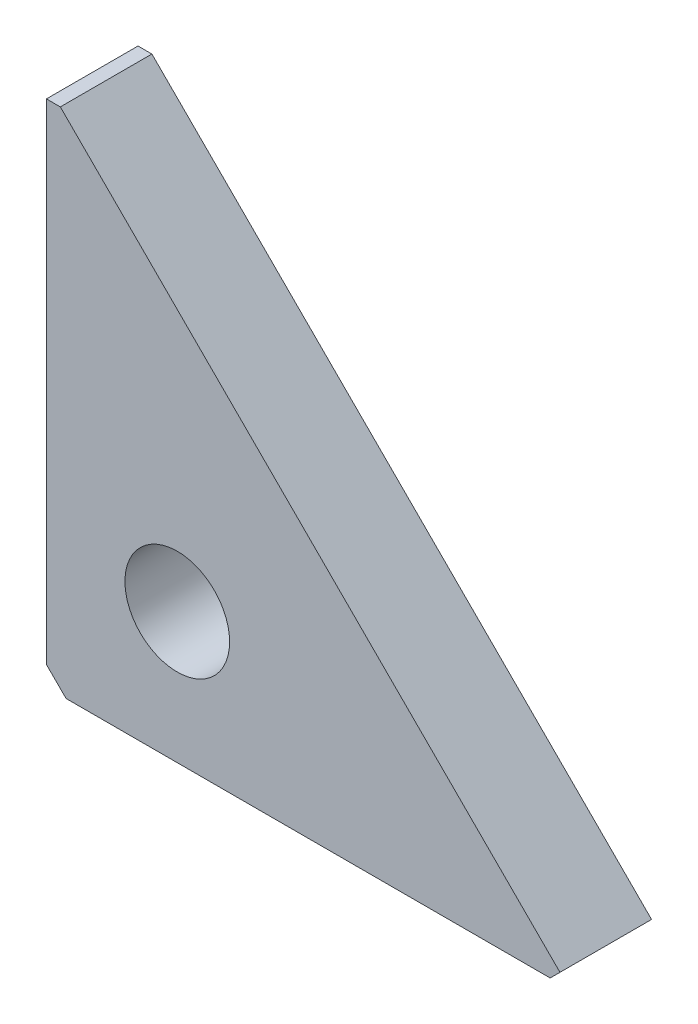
from build123d import *
from OCP.BRepFilletAPI import BRepFilletAPI_MakeChamfer

# Parameters (mm, degrees)
EXTRUDE_1_DEPTH     = 14
CHAMFER_1_SIZE      = 3
CHAMFER_1_SIZE2     = 2.121320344
SKETCH_3_R          = 8
CUT_EXTRUDE_1_DEPTH = 113.952423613


with BuildPart() as part:
    # Sketch 1 → Extrude 1 (new body)
    with BuildSketch(Plane.XY):
        Polygon((0, 0), (0, -80), (80, -80), align=None)
    extrude(amount=EXTRUDE_1_DEPTH)

    # Chamfer 1: one chamfer whose edges measure the first distance from different faces: ONE call of the kernel's chamfer builder (chamfer() names one face for all edges)
    chamfer_1_edges_1 = [part.edges().sort_by_distance(p)[0] for p in [
        (80, -80, 7),
    ]]
    chamfer_1_side_1 = [part.faces().sort_by_distance(p)[0] for p in [
        (40, -80, 7),
    ]]
    chamfer_1_edges_2 = [part.edges().sort_by_distance(p)[0] for p in [
        (0, -80, 7),
    ]]
    chamfer_1_edges_3 = [part.edges().sort_by_distance(p)[0] for p in [
        (0, 0, 7),
    ]]
    chamfer_1_side_3 = [part.faces().sort_by_distance(p)[0] for p in [
        (40, -40, 7),
    ]]
    chamfer_1 = BRepFilletAPI_MakeChamfer(part.part.solid().wrapped)
    for e in chamfer_1_edges_1:
        chamfer_1.Add(CHAMFER_1_SIZE, CHAMFER_1_SIZE2, e.wrapped, chamfer_1_side_1[0].wrapped)  # the first distance lies on this face
    for e in chamfer_1_edges_2:
        chamfer_1.Add(CHAMFER_1_SIZE, e.wrapped)
    for e in chamfer_1_edges_3:
        chamfer_1.Add(CHAMFER_1_SIZE, CHAMFER_1_SIZE2, e.wrapped, chamfer_1_side_3[0].wrapped)  # the first distance lies on this face
    add(Compound.cast(chamfer_1.Shape()), mode=Mode.REPLACE)

    # Sketch 3 → Cut-Extrude 1 (cut, through all)
    with BuildSketch(Plane.XY.offset(14)):
        with Locations((20, -60)):
            Circle(SKETCH_3_R)
    extrude(amount=-CUT_EXTRUDE_1_DEPTH, mode=Mode.SUBTRACT)


solid = part.part
